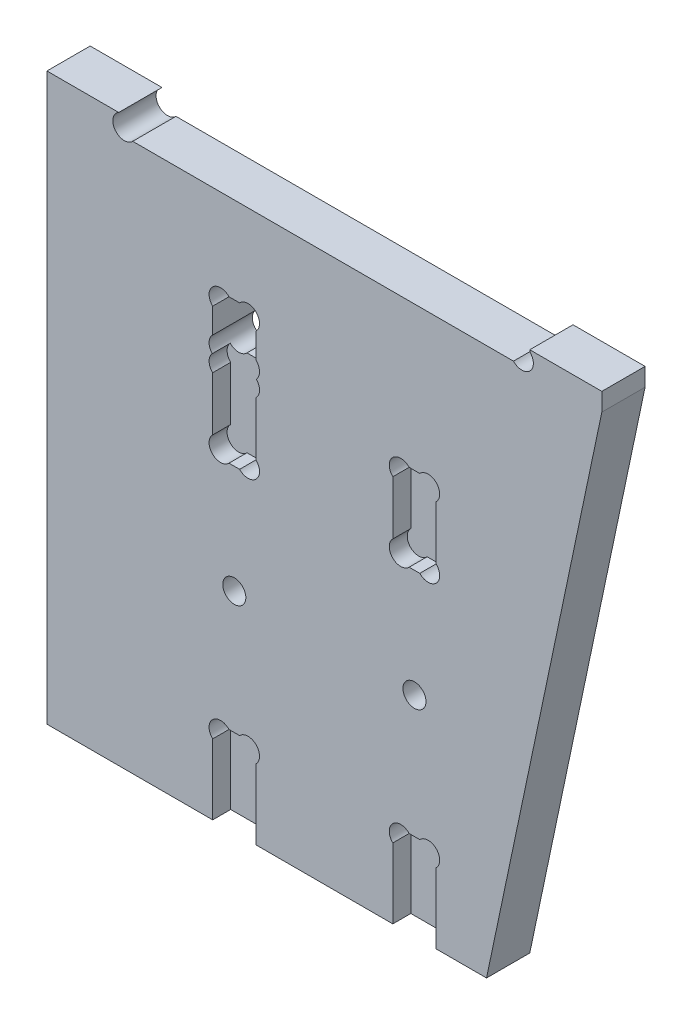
from build123d import *

# Parameters (mm, degrees)
BOSS_EXTRU_1_DEPTH      = 6
ESQUISSE5_R             = 1.6
ENL_V_MAT_EXTRU_3_DEPTH = 93.477024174
ENL_V_MAT_EXTRU_4_DEPTH = 2.5
ENL_V_MAT_EXTRU_5_DEPTH = 10
ESQUISSE8_W             = 119.676604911
ESQUISSE8_H             = 12.799636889
ENL_V_MAT_EXTRU_6_DEPTH = 10


with BuildPart() as part:
    # Esquisse2 → Boss.-Extru.1 (new body)
    with BuildSketch(Plane.XY):
        with BuildLine():
            Line((-31, 80), (-21, 80))
            Line((-21, 80), (-21, 76.517835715))
            ThreePointArc((-21, 76.517835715), (-21.534903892, 74.135152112), (-19.096659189, 74))
            Line((-19.096659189, 74), (33.738104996, 74))
            ThreePointArc((33.738104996, 74), (36.03137085, 73.96862915), (36, 76.261895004))
            Line((36, 76.261895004), (36, 80))
            Line((36, 80), (46, 80))
            Line((46, 80), (46, 74))
            Line((46, 74), (30, -2))
            Line((30, -2), (23, -2))
            Line((23, -2), (-6, -2))
            Line((-6, -2), (-31, -2))
            Line((-31, -2), (-31, 0))
            Line((-31, 0), (-31, 74))
            Line((-31, 74), (-31, 80))
        make_face()
    extrude(amount=-BOSS_EXTRU_1_DEPTH)

    # Esquisse5 → Enl_v. mat.-Extru.3 (cut, through all)
    with BuildSketch(Plane.XY):
        with Locations((-5, 27)):
            Circle(ESQUISSE5_R)
        with Locations((20, 27)):
            Circle(ESQUISSE5_R)
    extrude(amount=-ENL_V_MAT_EXTRU_3_DEPTH, mode=Mode.SUBTRACT)

    # Esquisse6 → Enl_v. mat.-Extru.4 (cut)
    with BuildSketch(Plane.XY):
        with BuildLine():
            Line((-5.738104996, 54), (-4.261895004, 54))
            ThreePointArc((-4.261895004, 54), (-1.96862915, 54.03137085), (-2, 51.738104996))
            Line((-2, 51.738104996), (-2, 44.261895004))
            ThreePointArc((-2, 44.261895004), (-1.96862915, 41.96862915), (-4.261895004, 42))
            Line((-4.261895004, 42), (-5.738104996, 42))
            ThreePointArc((-5.738104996, 42), (-8.03137085, 41.96862915), (-8, 44.261895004))
            Line((-8, 44.261895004), (-8, 51.738104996))
            ThreePointArc((-8, 51.738104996), (-8.03137085, 54.03137085), (-5.738104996, 54))
        make_face()
        with BuildLine():
            Line((20.738104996, 54), (19.261895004, 54))
            ThreePointArc((19.261895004, 54), (16.96862915, 54.03137085), (17, 51.738104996))
            Line((17, 51.738104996), (17, 44.261895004))
            ThreePointArc((17, 44.261895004), (16.96862915, 41.96862915), (19.261895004, 42))
            Line((19.261895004, 42), (20.738104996, 42))
            ThreePointArc((20.738104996, 42), (23.03137085, 41.96862915), (23, 44.261895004))
            Line((23, 44.261895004), (23, 51.738104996))
            ThreePointArc((23, 51.738104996), (23.03137085, 54.03137085), (20.738104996, 54))
        make_face()
        with BuildLine():
            Line((19.261895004, 10), (20.738104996, 10))
            ThreePointArc((20.738104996, 10), (23.03137085, 10.03137085), (23, 7.738104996))
            Line((23, 7.738104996), (23, -2))
            Line((23, -2), (23, -4.5))
            Line((23, -4.5), (17, -4.5))
            Line((17, -4.5), (17, -2))
            Line((17, -2), (17, 7.738104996))
            ThreePointArc((17, 7.738104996), (16.96862915, 10.03137085), (19.261895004, 10))
        make_face()
        with BuildLine():
            Line((-2, 7.738104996), (-2, -2))
            Line((-2, -2), (-2, -4.5))
            Line((-2, -4.5), (-8, -4.5))
            Line((-8, -4.5), (-8, -2))
            Line((-8, -2), (-8, 7.738104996))
            ThreePointArc((-8, 7.738104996), (-8.03137085, 10.03137085), (-5.738104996, 10))
            Line((-5.738104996, 10), (-4.261895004, 10))
            ThreePointArc((-4.261895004, 10), (-1.96862915, 10.03137085), (-2, 7.738104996))
        make_face()
    extrude(amount=-ENL_V_MAT_EXTRU_4_DEPTH, mode=Mode.SUBTRACT)

    # Esquisse7 → Enl_v. mat.-Extru.5 (cut)
    with BuildSketch(Plane.XY):
        with BuildLine():
            Line((-5.738104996, 62), (-4.261895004, 62))
            ThreePointArc((-4.261895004, 62), (-1.96862915, 62.03137085), (-2, 59.738104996))
            Line((-2, 59.738104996), (-2, 56.261895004))
            ThreePointArc((-2, 56.261895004), (-1.96862915, 53.96862915), (-4.261895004, 54))
            Line((-4.261895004, 54), (-5.738104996, 54))
            ThreePointArc((-5.738104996, 54), (-8.03137085, 53.96862915), (-8, 56.261895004))
            Line((-8, 56.261895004), (-8, 59.738104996))
            ThreePointArc((-8, 59.738104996), (-8.03137085, 62.03137085), (-5.738104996, 62))
        make_face()
    extrude(amount=-ENL_V_MAT_EXTRU_5_DEPTH, mode=Mode.SUBTRACT)

    # Esquisse8 → Enl_v. mat.-Extru.6 (cut)
    with BuildSketch(Plane.XY):
        with Locations((11.469871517, 82.899818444)):
            Rectangle(ESQUISSE8_W, ESQUISSE8_H)
    extrude(amount=-ENL_V_MAT_EXTRU_6_DEPTH, mode=Mode.SUBTRACT)


solid = part.part
